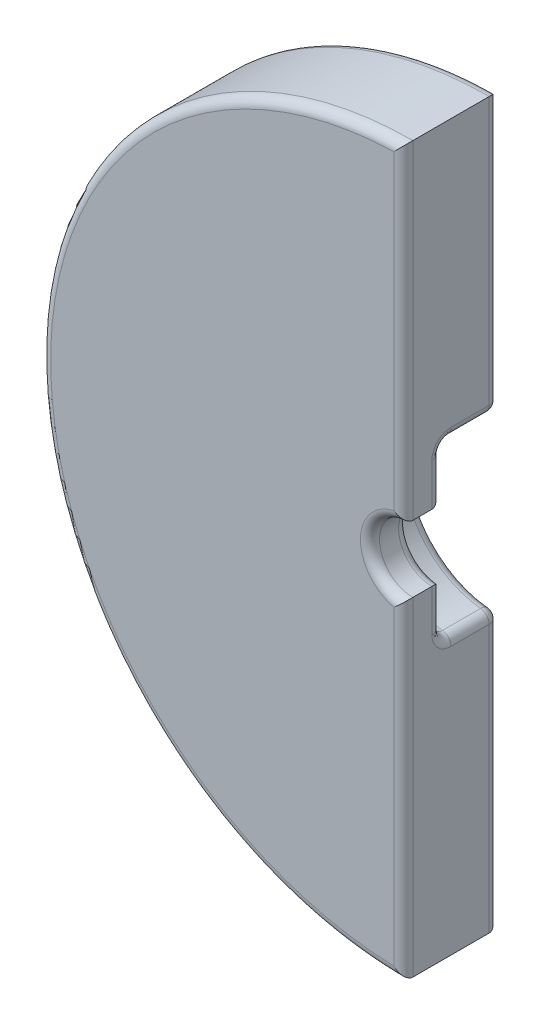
from build123d import *

# Parameters (mm, degrees)
EXTRUDE_1_DEPTH     = 2.5
SKETCH_2_R          = 4.5
CUT_EXTRUDE_1_DEPTH = 3
FILLET_1_R          = 0.5


with BuildPart() as part:
    # Sketch 1 → Extrude 1 (new, symmetric)
    with BuildSketch(Plane.XY):
        with BuildLine():
            Line((0, 19), (0, 1.75))
            ThreePointArc((0, 1.75), (-1.75, 0), (0, -1.75))
            Line((0, -1.75), (0, -19))
            ThreePointArc((0, -19), (-19, 0), (0, 19))
        make_face()
    extrude(amount=EXTRUDE_1_DEPTH, both=True)

    # Sketch 2 → Cut-Extrude 1 (cut)
    with BuildSketch(Plane(origin=(0, 0, -2.5), x_dir=(-1, 0, 0), z_dir=(0, 0, -1))):
        Circle(SKETCH_2_R)
    extrude(amount=-CUT_EXTRUDE_1_DEPTH, mode=Mode.SUBTRACT)

    # Fillet 1
    fillet_1_edges = [part.edges().sort_by_distance(p)[0] for p in [
        (-19, 0, 2.5),
        (0, -10.375, 2.5),
        (0, 11.75, -2.5),
        (-4.5, 0, -2.5),
        (0, -3.125, 0.5),
        (-4.5, 0, 0.5),
        (0, 4.5, -1),
        (0, -4.5, -1),
        (0, 3.125, 0.5),
        (-1.75, 0, 0.5),
        (-1.75, 0, 2.5),
        (0, -11.75, -2.5),
        (-19, 0, -2.5),
        (0, 10.375, 2.5),
    ]]
    fillet(fillet_1_edges, radius=FILLET_1_R)


solid = part.part
